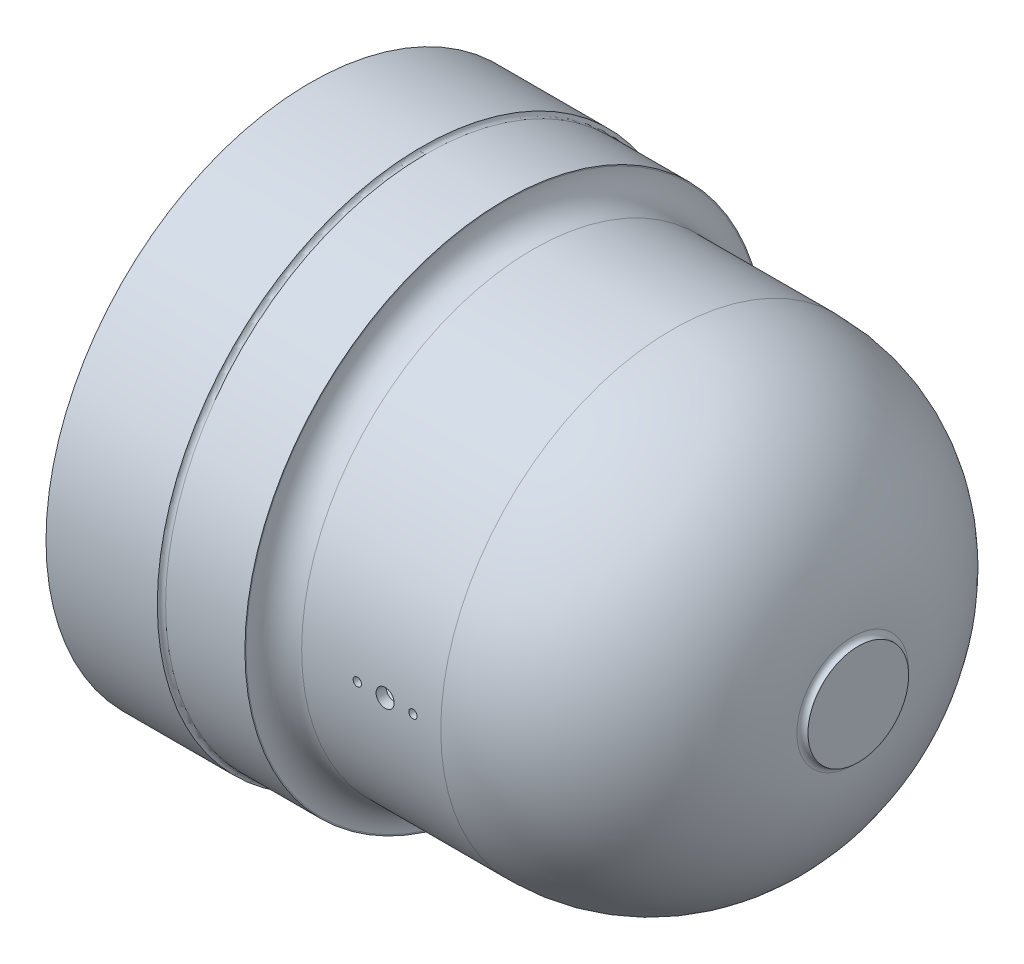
ISO-10303-21;
HEADER;
FILE_DESCRIPTION(('STEP AP214'),'2;1');
FILE_NAME('part.step','',(''),(''),'','','');
FILE_SCHEMA(('AUTOMOTIVE_DESIGN { 1 0 10303 214 1 1 1 1 }'));
ENDSEC;
DATA;
#1=APPLICATION_CONTEXT('core data for automotive mechanical design processes');
#2=APPLICATION_PROTOCOL_DEFINITION('international standard','automotive_design',2000,#1);
#3=PRODUCT_CONTEXT('',#1,'mechanical');
#4=PRODUCT('Part','Part','',(#3));
#5=PRODUCT_RELATED_PRODUCT_CATEGORY('part','',(#4));
#6=PRODUCT_DEFINITION_FORMATION('','',#4);
#7=PRODUCT_DEFINITION_CONTEXT('part definition',#1,'design');
#8=PRODUCT_DEFINITION('design','',#6,#7);
#9=PRODUCT_DEFINITION_SHAPE('','',#8);
#10=(LENGTH_UNIT() NAMED_UNIT(*) SI_UNIT(.MILLI.,.METRE.));
#11=(NAMED_UNIT(*) PLANE_ANGLE_UNIT() SI_UNIT($,.RADIAN.));
#12=(NAMED_UNIT(*) SI_UNIT($,.STERADIAN.) SOLID_ANGLE_UNIT());
#13=UNCERTAINTY_MEASURE_WITH_UNIT(LENGTH_MEASURE(1.E-05),#10,'distance_accuracy_value','');
#14=(GEOMETRIC_REPRESENTATION_CONTEXT(3) GLOBAL_UNCERTAINTY_ASSIGNED_CONTEXT((#13)) GLOBAL_UNIT_ASSIGNED_CONTEXT((#10,
#11,#12)) REPRESENTATION_CONTEXT('',''));
#15=CARTESIAN_POINT('',(0.,0.,0.));
#16=DIRECTION('',(0.,0.,1.));
#17=DIRECTION('',(1.,0.,0.));
#18=AXIS2_PLACEMENT_3D('',#15,#16,#17);
#19=CARTESIAN_POINT('',(-65.0147222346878,0.,0.));
#20=DIRECTION('',(-1.,0.,0.));
#21=DIRECTION('',(0.,0.,1.));
#22=AXIS2_PLACEMENT_3D('',#19,#20,#21);
#23=CYLINDRICAL_SURFACE('',#22,83.1);
#24=CARTESIAN_POINT('',(56.4852777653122,0.,83.1));
#25=CARTESIAN_POINT('',(56.4852740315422,-0.0842482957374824,83.0999998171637));
#26=CARTESIAN_POINT('',(56.4781561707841,-0.168557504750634,83.0998705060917));
#27=CARTESIAN_POINT('',(56.4498606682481,-0.334853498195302,83.0993670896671));
#28=CARTESIAN_POINT('',(56.4286661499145,-0.416837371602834,83.0989926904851));
#29=CARTESIAN_POINT('',(56.3728213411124,-0.576049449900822,83.0980415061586));
#30=CARTESIAN_POINT('',(56.3381775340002,-0.653279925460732,83.0974648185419));
#31=CARTESIAN_POINT('',(56.2564266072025,-0.800807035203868,83.0961741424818));
#32=CARTESIAN_POINT('',(56.2093225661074,-0.871105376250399,83.0954601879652));
#33=CARTESIAN_POINT('',(56.1039730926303,-1.00281262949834,83.0939751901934));
#34=CARTESIAN_POINT('',(56.0457253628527,-1.06421970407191,83.0932041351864));
#35=CARTESIAN_POINT('',(55.9197450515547,-1.17638615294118,83.0916919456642));
#36=CARTESIAN_POINT('',(55.8520120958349,-1.22714510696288,83.0909508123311));
#37=CARTESIAN_POINT('',(55.7089814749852,-1.31657398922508,83.0895820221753));
#38=CARTESIAN_POINT('',(55.6336834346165,-1.35524331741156,83.0889543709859));
#39=CARTESIAN_POINT('',(55.4776628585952,-1.41939115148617,83.087883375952));
#40=CARTESIAN_POINT('',(55.3969403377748,-1.44486969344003,83.0874400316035));
#41=CARTESIAN_POINT('',(55.2323714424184,-1.48191014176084,83.0867876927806));
#42=CARTESIAN_POINT('',(55.1485254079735,-1.49347355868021,83.0865786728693));
#43=CARTESIAN_POINT('',(54.9800820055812,-1.50236014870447,83.0864184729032));
#44=CARTESIAN_POINT('',(54.8954846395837,-1.49968335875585,83.0864672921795));
#45=CARTESIAN_POINT('',(54.7279502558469,-1.48016684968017,83.0868172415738));
#46=CARTESIAN_POINT('',(54.6450130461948,-1.46332877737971,83.0871183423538));
#47=CARTESIAN_POINT('',(54.4831427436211,-1.4159702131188,83.087938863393));
#48=CARTESIAN_POINT('',(54.4042096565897,-1.38544970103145,83.0884582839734));
#49=CARTESIAN_POINT('',(54.2525830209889,-1.31159074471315,83.0896569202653));
#50=CARTESIAN_POINT('',(54.1798898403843,-1.26825154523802,83.0903361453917));
#51=CARTESIAN_POINT('',(54.0428105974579,-1.16998605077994,83.0917778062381));
#52=CARTESIAN_POINT('',(53.9784245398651,-1.11505974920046,83.0925402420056));
#53=CARTESIAN_POINT('',(53.8597776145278,-0.995169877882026,83.0940624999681));
#54=CARTESIAN_POINT('',(53.8055181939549,-0.93020487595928,83.0948223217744));
#55=CARTESIAN_POINT('',(53.7086759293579,-0.792086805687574,83.0962535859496));
#56=CARTESIAN_POINT('',(53.6660930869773,-0.718933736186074,83.0969250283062));
#57=CARTESIAN_POINT('',(53.5938129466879,-0.566515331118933,83.0981038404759));
#58=CARTESIAN_POINT('',(53.5641156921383,-0.487249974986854,83.0986112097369));
#59=CARTESIAN_POINT('',(53.5184506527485,-0.324857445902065,83.0994046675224));
#60=CARTESIAN_POINT('',(53.5024828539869,-0.241730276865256,83.0996907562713));
#61=CARTESIAN_POINT('',(53.4847317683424,-0.0739864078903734,83.100009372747));
#62=CARTESIAN_POINT('',(53.4829464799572,0.0106300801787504,83.1000419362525));
#63=CARTESIAN_POINT('',(53.4936058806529,0.178961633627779,83.0998499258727));
#64=CARTESIAN_POINT('',(53.5060505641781,0.262676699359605,83.0996253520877));
#65=CARTESIAN_POINT('',(53.5448149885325,0.426823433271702,83.0989444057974));
#66=CARTESIAN_POINT('',(53.5711338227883,0.507255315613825,83.0984880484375));
#67=CARTESIAN_POINT('',(53.6368985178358,0.66255903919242,83.0973949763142));
#68=CARTESIAN_POINT('',(53.6763443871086,0.737430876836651,83.0967582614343));
#69=CARTESIAN_POINT('',(53.7672485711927,0.879498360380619,83.0953761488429));
#70=CARTESIAN_POINT('',(53.8187082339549,0.946693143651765,83.0946307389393));
#71=CARTESIAN_POINT('',(53.9321772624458,1.07149043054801,83.0931153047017));
#72=CARTESIAN_POINT('',(53.9941866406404,1.12909292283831,83.0923452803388));
#73=CARTESIAN_POINT('',(54.127003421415,1.23307713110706,83.090867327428));
#74=CARTESIAN_POINT('',(54.1978118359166,1.27945755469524,83.0901594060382));
#75=CARTESIAN_POINT('',(54.3462114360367,1.35967217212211,83.0888855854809));
#76=CARTESIAN_POINT('',(54.423802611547,1.39350638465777,83.0883196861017));
#77=CARTESIAN_POINT('',(54.5835603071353,1.44766590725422,83.0873937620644));
#78=CARTESIAN_POINT('',(54.66572654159,1.46799205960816,83.08703372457));
#79=CARTESIAN_POINT('',(54.8323060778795,1.49456124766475,83.0865600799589));
#80=CARTESIAN_POINT('',(54.9167193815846,1.5008042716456,83.0864464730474));
#81=CARTESIAN_POINT('',(55.085383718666,1.49902984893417,83.0864785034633));
#82=CARTESIAN_POINT('',(55.1696347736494,1.49101445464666,83.0866241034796));
#83=CARTESIAN_POINT('',(55.3355952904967,1.46095491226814,83.0871580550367));
#84=CARTESIAN_POINT('',(55.4173047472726,1.43891073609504,83.0875464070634));
#85=CARTESIAN_POINT('',(55.5758642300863,1.38141934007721,83.0885220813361));
#86=CARTESIAN_POINT('',(55.6527141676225,1.3459718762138,83.0891094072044));
#87=CARTESIAN_POINT('',(55.7993696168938,1.26268180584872,83.0904167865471));
#88=CARTESIAN_POINT('',(55.8691753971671,1.21483967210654,83.0911368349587));
#89=CARTESIAN_POINT('',(55.9997681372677,1.10811598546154,83.0926285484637));
#90=CARTESIAN_POINT('',(56.0605547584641,1.04923401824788,83.0934002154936));
#91=CARTESIAN_POINT('',(56.1713957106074,0.922083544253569,83.0949083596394));
#92=CARTESIAN_POINT('',(56.2214473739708,0.85381271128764,83.0956448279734));
#93=CARTESIAN_POINT('',(56.3094008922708,0.709805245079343,83.0969997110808));
#94=CARTESIAN_POINT('',(56.3472961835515,0.634064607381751,83.0976180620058));
#95=CARTESIAN_POINT('',(56.4097891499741,0.477354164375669,83.0986657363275));
#96=CARTESIAN_POINT('',(56.4344027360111,0.396390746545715,83.0990952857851));
#97=CARTESIAN_POINT('',(56.4630870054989,0.262427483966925,83.099601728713));
#98=CARTESIAN_POINT('',(56.4713981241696,0.210297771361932,83.0997504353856));
#99=CARTESIAN_POINT('',(56.4824946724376,0.105453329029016,83.0999496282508));
#100=CARTESIAN_POINT('',(56.4852801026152,0.0527385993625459,83.1000001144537));
#101=CARTESIAN_POINT('',(56.4852777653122,0.,83.1));
#102=B_SPLINE_CURVE_WITH_KNOTS('',3,(#24,#25,#26,#27,#28,#29,#30,#31,#32,#33,#34,#35,#36,#37,
#38,#39,#40,#41,#42,#43,#44,#45,#46,#47,#48,#49,#50,#51,#52,#53,#54,#55,#56,#57,#58,#59,#60,#61,
#62,#63,#64,#65,#66,#67,#68,#69,#70,#71,#72,#73,#74,#75,#76,#77,#78,#79,#80,#81,#82,#83,#84,#85,
#86,#87,#88,#89,#90,#91,#92,#93,#94,#95,#96,#97,#98,#99,#100,#101),.UNSPECIFIED.,.T.,.F.,(4,2,2,
2,2,2,2,2,2,2,2,2,2,2,2,2,2,2,2,2,2,2,2,2,2,2,2,2,2,2,2,2,2,2,2,2,2,2,4),(0.,0.252552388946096,
0.505408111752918,0.758142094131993,1.01081369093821,1.26353743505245,1.5162711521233,
1.76901741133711,2.02176297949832,2.27448110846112,2.52719858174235,2.77988667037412,
3.03257513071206,3.28527848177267,3.53798197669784,3.79072155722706,4.04346117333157,
4.29620163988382,4.54894185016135,4.80164639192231,5.05435083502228,5.30703876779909,
5.55972686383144,5.81244332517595,6.06516008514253,6.31790593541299,6.57065140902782,
6.82338112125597,7.07611104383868,7.32880459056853,7.58149864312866,7.8341972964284,
8.08688631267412,8.33958481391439,8.59234603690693,8.84524350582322,9.09783733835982,
9.2559326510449,9.41402794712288),.UNSPECIFIED.);
#103=CARTESIAN_POINT('',(56.4852777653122,0.,83.1));
#104=VERTEX_POINT('',#103);
#105=EDGE_CURVE('E59',#104,#104,#102,.T.);
#106=ORIENTED_EDGE('',*,*,#105,.T.);
#107=EDGE_LOOP('',(#106));
#108=FACE_BOUND('',#107,.T.);
#109=CARTESIAN_POINT('',(64.9852777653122,0.,0.));
#110=DIRECTION('',(-1.,0.,0.));
#111=DIRECTION('',(0.,0.,1.));
#112=AXIS2_PLACEMENT_3D('',#109,#110,#111);
#113=CIRCLE('',#112,83.1);
#114=CARTESIAN_POINT('',(64.9852777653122,0.,83.1));
#115=VERTEX_POINT('',#114);
#116=EDGE_CURVE('E120',#115,#115,#113,.T.);
#117=ORIENTED_EDGE('',*,*,#116,.T.);
#118=EDGE_LOOP('',(#117));
#119=FACE_BOUND('',#118,.T.);
#120=CARTESIAN_POINT('',(14.9852777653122,0.,0.));
#121=DIRECTION('',(1.,0.,0.));
#122=DIRECTION('',(0.,0.,-1.));
#123=AXIS2_PLACEMENT_3D('',#120,#121,#122);
#124=CIRCLE('',#123,83.1);
#125=CARTESIAN_POINT('',(14.9852777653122,0.,-83.1));
#126=VERTEX_POINT('',#125);
#127=EDGE_CURVE('E126',#126,#126,#124,.T.);
#128=ORIENTED_EDGE('',*,*,#127,.T.);
#129=EDGE_LOOP('',(#128));
#130=FACE_BOUND('',#129,.T.);
#131=CARTESIAN_POINT('',(48.2352777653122,0.,83.1));
#132=CARTESIAN_POINT('',(48.2352696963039,-0.182479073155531,83.0999991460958));
#133=CARTESIAN_POINT('',(48.2198575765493,-0.365088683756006,83.0993924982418));
#134=CARTESIAN_POINT('',(48.1585923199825,-0.725273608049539,83.0970307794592));
#135=CARTESIAN_POINT('',(48.1127030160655,-0.902842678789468,83.0952743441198));
#136=CARTESIAN_POINT('',(47.9917963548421,-1.24767655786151,83.090811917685));
#137=CARTESIAN_POINT('',(47.9167934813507,-1.41494644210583,83.088106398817));
#138=CARTESIAN_POINT('',(47.7398101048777,-1.7344753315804,83.0820507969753));
#139=CARTESIAN_POINT('',(47.6378361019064,-1.88673794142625,83.0787008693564));
#140=CARTESIAN_POINT('',(47.4097269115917,-2.17207900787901,83.071730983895));
#141=CARTESIAN_POINT('',(47.2835777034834,-2.30514625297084,83.0681108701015));
#142=CARTESIAN_POINT('',(47.0107255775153,-2.5482242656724,83.0610099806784));
#143=CARTESIAN_POINT('',(46.8640218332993,-2.65823410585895,83.0575292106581));
#144=CARTESIAN_POINT('',(46.5541732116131,-2.85209998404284,83.0510985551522));
#145=CARTESIAN_POINT('',(46.3910233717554,-2.93594809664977,83.048148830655));
#146=CARTESIAN_POINT('',(46.0529488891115,-3.07505927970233,83.0431146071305));
#147=CARTESIAN_POINT('',(45.8780243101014,-3.13032250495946,83.0410301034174));
#148=CARTESIAN_POINT('',(45.5214614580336,-3.21066782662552,83.0379626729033));
#149=CARTESIAN_POINT('',(45.3398266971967,-3.23576548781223,83.0369791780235));
#150=CARTESIAN_POINT('',(44.9749197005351,-3.25511524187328,83.0362229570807));
#151=CARTESIAN_POINT('',(44.7916474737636,-3.24936750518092,83.0364502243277));
#152=CARTESIAN_POINT('',(44.4287736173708,-3.20720266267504,83.0380893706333));
#153=CARTESIAN_POINT('',(44.2491700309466,-3.17080236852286,83.039500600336));
#154=CARTESIAN_POINT('',(43.8986246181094,-3.06839171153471,83.0433475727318));
#155=CARTESIAN_POINT('',(43.727682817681,-3.00238125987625,83.0457833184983));
#156=CARTESIAN_POINT('',(43.3992592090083,-2.84260481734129,83.0514055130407));
#157=CARTESIAN_POINT('',(43.2417811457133,-2.74883113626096,83.0545921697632));
#158=CARTESIAN_POINT('',(42.9447962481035,-2.53619577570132,83.0613567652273));
#159=CARTESIAN_POINT('',(42.8052894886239,-2.4173339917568,83.0649347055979));
#160=CARTESIAN_POINT('',(42.5481093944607,-2.15780147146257,83.0720814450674));
#161=CARTESIAN_POINT('',(42.4304507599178,-2.01711616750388,83.0756502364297));
#162=CARTESIAN_POINT('',(42.2204200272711,-1.71798145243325,83.08237408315));
#163=CARTESIAN_POINT('',(42.1280479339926,-1.55953203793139,83.0855291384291));
#164=CARTESIAN_POINT('',(41.9712139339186,-1.2293585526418,83.0910699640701));
#165=CARTESIAN_POINT('',(41.9067525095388,-1.05763425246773,83.0934557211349));
#166=CARTESIAN_POINT('',(41.8075791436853,-0.705789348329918,83.097188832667));
#167=CARTESIAN_POINT('',(41.7728670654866,-0.525668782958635,83.0985361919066));
#168=CARTESIAN_POINT('',(41.7341957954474,-0.162272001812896,83.1000400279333));
#169=CARTESIAN_POINT('',(41.7302162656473,0.02100204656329,83.1001972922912));
#170=CARTESIAN_POINT('',(41.7530700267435,0.385615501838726,83.0993053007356));
#171=CARTESIAN_POINT('',(41.7799032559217,0.566954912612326,83.0982560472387));
#172=CARTESIAN_POINT('',(41.8636040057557,0.922494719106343,83.0950697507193));
#173=CARTESIAN_POINT('',(41.9204622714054,1.09669729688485,83.0929330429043));
#174=CARTESIAN_POINT('',(42.0625897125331,1.43308555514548,83.0878125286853));
#175=CARTESIAN_POINT('',(42.1478589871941,1.59527119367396,83.084828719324));
#176=CARTESIAN_POINT('',(42.3444402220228,1.90311524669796,83.0783479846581));
#177=CARTESIAN_POINT('',(42.4557658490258,2.04876492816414,83.0748507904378));
#178=CARTESIAN_POINT('',(42.7012796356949,2.31931486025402,83.0677382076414));
#179=CARTESIAN_POINT('',(42.835467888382,2.4442150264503,83.0641228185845));
#180=CARTESIAN_POINT('',(43.1229851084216,2.66978861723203,83.0571791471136));
#181=CARTESIAN_POINT('',(43.2763243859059,2.77044890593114,83.0538510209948));
#182=CARTESIAN_POINT('',(43.5977385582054,2.94459559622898,83.0478595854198));
#183=CARTESIAN_POINT('',(43.7658134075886,3.01808208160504,83.0451962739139));
#184=CARTESIAN_POINT('',(44.1118785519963,3.13577216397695,83.0408358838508));
#185=CARTESIAN_POINT('',(44.2898659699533,3.17998421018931,83.0391385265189));
#186=CARTESIAN_POINT('',(44.6507443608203,3.23789806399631,83.0369006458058));
#187=CARTESIAN_POINT('',(44.8336353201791,3.25159995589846,83.0363601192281));
#188=CARTESIAN_POINT('',(45.1989981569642,3.24810360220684,83.0364969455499));
#189=CARTESIAN_POINT('',(45.3814702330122,3.23092604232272,83.0371734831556));
#190=CARTESIAN_POINT('',(45.7409381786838,3.16620104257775,83.0396664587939));
#191=CARTESIAN_POINT('',(45.9179340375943,3.11865354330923,83.0414828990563));
#192=CARTESIAN_POINT('',(46.2614310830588,2.99454203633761,83.0460507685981));
#193=CARTESIAN_POINT('',(46.4279321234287,2.91797762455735,83.0488022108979));
#194=CARTESIAN_POINT('',(46.7457153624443,2.73801052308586,83.0549298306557));
#195=CARTESIAN_POINT('',(46.8969980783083,2.63460874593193,83.0583059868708));
#196=CARTESIAN_POINT('',(47.1801506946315,2.40383267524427,83.0653049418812));
#197=CARTESIAN_POINT('',(47.3120096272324,2.27644492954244,83.0689278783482));
#198=CARTESIAN_POINT('',(47.5525081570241,2.00130371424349,83.076011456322));
#199=CARTESIAN_POINT('',(47.6611420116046,1.8535452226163,83.0794720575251));
#200=CARTESIAN_POINT('',(47.8521377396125,1.54177630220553,83.0858425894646));
#201=CARTESIAN_POINT('',(47.9344793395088,1.37775345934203,83.0887520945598));
#202=CARTESIAN_POINT('',(48.0703586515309,1.0383250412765,83.0936855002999));
#203=CARTESIAN_POINT('',(48.1239305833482,0.862933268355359,83.0957104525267));
#204=CARTESIAN_POINT('',(48.1866097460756,0.572033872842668,83.0981075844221));
#205=CARTESIAN_POINT('',(48.2048371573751,0.458412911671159,83.0988141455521));
#206=CARTESIAN_POINT('',(48.2291737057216,0.229878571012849,83.09976062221));
#207=CARTESIAN_POINT('',(48.2352828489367,0.114965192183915,83.1000005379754));
#208=CARTESIAN_POINT('',(48.2352777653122,0.,83.1));
#209=B_SPLINE_CURVE_WITH_KNOTS('',3,(#131,#132,#133,#134,#135,#136,#137,#138,#139,#140,#141,
#142,#143,#144,#145,#146,#147,#148,#149,#150,#151,#152,#153,#154,#155,#156,#157,#158,#159,#160,
#161,#162,#163,#164,#165,#166,#167,#168,#169,#170,#171,#172,#173,#174,#175,#176,#177,#178,#179,
#180,#181,#182,#183,#184,#185,#186,#187,#188,#189,#190,#191,#192,#193,#194,#195,#196,#197,#198,
#199,#200,#201,#202,#203,#204,#205,#206,#207,#208),.UNSPECIFIED.,.T.,.F.,(4,2,2,2,2,2,2,2,2,2,2,
2,2,2,2,2,2,2,2,2,2,2,2,2,2,2,2,2,2,2,2,2,2,2,2,2,2,2,4),(0.,0.547017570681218,1.09468544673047,
1.6420812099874,2.18934517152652,2.73692749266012,3.2845318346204,3.83230190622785,
4.38006901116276,4.92755335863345,5.47503468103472,6.02221592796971,6.56939881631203,
7.11673341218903,7.66407028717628,8.21177410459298,8.75947802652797,9.30719141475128,
9.85490228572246,10.4022506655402,10.9495979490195,11.4967766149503,12.0439571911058,
12.5914254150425,13.1388958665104,13.6866623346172,14.2344271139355,14.7820337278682,
15.3296388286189,15.8768772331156,16.4241167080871,16.9713638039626,17.5185922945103,
18.0661286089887,18.6138001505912,19.161892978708,19.709332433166,20.0539637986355,
20.3985949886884),.UNSPECIFIED.);
#210=CARTESIAN_POINT('',(48.2352777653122,0.,83.1));
#211=VERTEX_POINT('',#210);
#212=EDGE_CURVE('E58',#211,#211,#209,.T.);
#213=ORIENTED_EDGE('',*,*,#212,.T.);
#214=EDGE_LOOP('',(#213));
#215=FACE_BOUND('',#214,.T.);
#216=CARTESIAN_POINT('',(36.4852777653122,0.,83.1));
#217=CARTESIAN_POINT('',(36.4852740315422,-0.0842482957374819,83.0999998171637));
#218=CARTESIAN_POINT('',(36.4781561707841,-0.168557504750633,83.0998705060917));
#219=CARTESIAN_POINT('',(36.4498606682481,-0.334853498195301,83.0993670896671));
#220=CARTESIAN_POINT('',(36.4286661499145,-0.416837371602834,83.0989926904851));
#221=CARTESIAN_POINT('',(36.3728213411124,-0.576049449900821,83.0980415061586));
#222=CARTESIAN_POINT('',(36.3381775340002,-0.653279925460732,83.0974648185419));
#223=CARTESIAN_POINT('',(36.2564266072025,-0.800807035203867,83.0961741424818));
#224=CARTESIAN_POINT('',(36.2093225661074,-0.871105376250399,83.0954601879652));
#225=CARTESIAN_POINT('',(36.1039730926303,-1.00281262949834,83.0939751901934));
#226=CARTESIAN_POINT('',(36.0457253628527,-1.06421970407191,83.0932041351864));
#227=CARTESIAN_POINT('',(35.9197450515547,-1.17638615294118,83.0916919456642));
#228=CARTESIAN_POINT('',(35.8520120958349,-1.22714510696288,83.0909508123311));
#229=CARTESIAN_POINT('',(35.7089814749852,-1.31657398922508,83.0895820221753));
#230=CARTESIAN_POINT('',(35.6336834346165,-1.35524331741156,83.0889543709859));
#231=CARTESIAN_POINT('',(35.4776628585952,-1.41939115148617,83.087883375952));
#232=CARTESIAN_POINT('',(35.3969403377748,-1.44486969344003,83.0874400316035));
#233=CARTESIAN_POINT('',(35.2323714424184,-1.48191014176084,83.0867876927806));
#234=CARTESIAN_POINT('',(35.1485254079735,-1.49347355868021,83.0865786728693));
#235=CARTESIAN_POINT('',(34.9800820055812,-1.50236014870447,83.0864184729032));
#236=CARTESIAN_POINT('',(34.8954846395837,-1.49968335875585,83.0864672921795));
#237=CARTESIAN_POINT('',(34.7279502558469,-1.48016684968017,83.0868172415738));
#238=CARTESIAN_POINT('',(34.6450130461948,-1.46332877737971,83.0871183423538));
#239=CARTESIAN_POINT('',(34.4831427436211,-1.4159702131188,83.087938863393));
#240=CARTESIAN_POINT('',(34.4042096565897,-1.38544970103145,83.0884582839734));
#241=CARTESIAN_POINT('',(34.2525830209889,-1.31159074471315,83.0896569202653));
#242=CARTESIAN_POINT('',(34.1798898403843,-1.26825154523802,83.0903361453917));
#243=CARTESIAN_POINT('',(34.0428105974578,-1.16998605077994,83.0917778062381));
#244=CARTESIAN_POINT('',(33.9784245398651,-1.11505974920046,83.0925402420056));
#245=CARTESIAN_POINT('',(33.8597776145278,-0.995169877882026,83.0940624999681));
#246=CARTESIAN_POINT('',(33.8055181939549,-0.930204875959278,83.0948223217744));
#247=CARTESIAN_POINT('',(33.7086759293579,-0.792086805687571,83.0962535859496));
#248=CARTESIAN_POINT('',(33.6660930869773,-0.718933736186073,83.0969250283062));
#249=CARTESIAN_POINT('',(33.5938129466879,-0.566515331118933,83.0981038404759));
#250=CARTESIAN_POINT('',(33.5641156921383,-0.487249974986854,83.0986112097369));
#251=CARTESIAN_POINT('',(33.5184506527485,-0.324857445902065,83.0994046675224));
#252=CARTESIAN_POINT('',(33.5024828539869,-0.241730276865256,83.0996907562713));
#253=CARTESIAN_POINT('',(33.4847317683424,-0.0739864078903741,83.100009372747));
#254=CARTESIAN_POINT('',(33.4829464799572,0.0106300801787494,83.1000419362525));
#255=CARTESIAN_POINT('',(33.4936058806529,0.178961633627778,83.0998499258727));
#256=CARTESIAN_POINT('',(33.5060505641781,0.262676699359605,83.0996253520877));
#257=CARTESIAN_POINT('',(33.5448149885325,0.426823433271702,83.0989444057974));
#258=CARTESIAN_POINT('',(33.5711338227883,0.507255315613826,83.0984880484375));
#259=CARTESIAN_POINT('',(33.6368985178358,0.662559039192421,83.0973949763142));
#260=CARTESIAN_POINT('',(33.6763443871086,0.737430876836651,83.0967582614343));
#261=CARTESIAN_POINT('',(33.7672485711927,0.879498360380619,83.0953761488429));
#262=CARTESIAN_POINT('',(33.8187082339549,0.946693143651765,83.0946307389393));
#263=CARTESIAN_POINT('',(33.9321772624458,1.07149043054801,83.0931153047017));
#264=CARTESIAN_POINT('',(33.9941866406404,1.12909292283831,83.0923452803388));
#265=CARTESIAN_POINT('',(34.127003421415,1.23307713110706,83.090867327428));
#266=CARTESIAN_POINT('',(34.1978118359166,1.27945755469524,83.0901594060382));
#267=CARTESIAN_POINT('',(34.3462114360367,1.35967217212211,83.0888855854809));
#268=CARTESIAN_POINT('',(34.423802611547,1.39350638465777,83.0883196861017));
#269=CARTESIAN_POINT('',(34.5835603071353,1.44766590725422,83.0873937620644));
#270=CARTESIAN_POINT('',(34.66572654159,1.46799205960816,83.08703372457));
#271=CARTESIAN_POINT('',(34.8323060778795,1.49456124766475,83.0865600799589));
#272=CARTESIAN_POINT('',(34.9167193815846,1.5008042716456,83.0864464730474));
#273=CARTESIAN_POINT('',(35.085383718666,1.49902984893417,83.0864785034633));
#274=CARTESIAN_POINT('',(35.1696347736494,1.49101445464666,83.0866241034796));
#275=CARTESIAN_POINT('',(35.3355952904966,1.46095491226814,83.0871580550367));
#276=CARTESIAN_POINT('',(35.4173047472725,1.43891073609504,83.0875464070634));
#277=CARTESIAN_POINT('',(35.5758642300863,1.38141934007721,83.0885220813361));
#278=CARTESIAN_POINT('',(35.6527141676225,1.34597187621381,83.0891094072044));
#279=CARTESIAN_POINT('',(35.7993696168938,1.26268180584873,83.0904167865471));
#280=CARTESIAN_POINT('',(35.8691753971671,1.21483967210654,83.0911368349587));
#281=CARTESIAN_POINT('',(35.9997681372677,1.10811598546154,83.0926285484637));
#282=CARTESIAN_POINT('',(36.0605547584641,1.04923401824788,83.0934002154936));
#283=CARTESIAN_POINT('',(36.1713957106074,0.92208354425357,83.0949083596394));
#284=CARTESIAN_POINT('',(36.2214473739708,0.85381271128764,83.0956448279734));
#285=CARTESIAN_POINT('',(36.3094008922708,0.709805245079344,83.0969997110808));
#286=CARTESIAN_POINT('',(36.3472961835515,0.634064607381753,83.0976180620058));
#287=CARTESIAN_POINT('',(36.4097891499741,0.477354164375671,83.0986657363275));
#288=CARTESIAN_POINT('',(36.4344027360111,0.396390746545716,83.0990952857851));
#289=CARTESIAN_POINT('',(36.4630870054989,0.262427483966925,83.099601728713));
#290=CARTESIAN_POINT('',(36.4713981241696,0.210297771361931,83.0997504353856));
#291=CARTESIAN_POINT('',(36.4824946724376,0.105453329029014,83.0999496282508));
#292=CARTESIAN_POINT('',(36.4852801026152,0.052738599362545,83.1000001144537));
#293=CARTESIAN_POINT('',(36.4852777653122,0.,83.1));
#294=B_SPLINE_CURVE_WITH_KNOTS('',3,(#216,#217,#218,#219,#220,#221,#222,#223,#224,#225,#226,
#227,#228,#229,#230,#231,#232,#233,#234,#235,#236,#237,#238,#239,#240,#241,#242,#243,#244,#245,
#246,#247,#248,#249,#250,#251,#252,#253,#254,#255,#256,#257,#258,#259,#260,#261,#262,#263,#264,
#265,#266,#267,#268,#269,#270,#271,#272,#273,#274,#275,#276,#277,#278,#279,#280,#281,#282,#283,
#284,#285,#286,#287,#288,#289,#290,#291,#292,#293),.UNSPECIFIED.,.T.,.F.,(4,2,2,2,2,2,2,2,2,2,2,
2,2,2,2,2,2,2,2,2,2,2,2,2,2,2,2,2,2,2,2,2,2,2,2,2,2,2,4),(0.,0.252552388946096,
0.505408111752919,0.758142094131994,1.01081369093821,1.26353743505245,1.5162711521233,
1.76901741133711,2.02176297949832,2.27448110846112,2.52719858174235,2.77988667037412,
3.03257513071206,3.28527848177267,3.53798197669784,3.79072155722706,4.04346117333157,
4.29620163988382,4.54894185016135,4.80164639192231,5.05435083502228,5.30703876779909,
5.55972686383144,5.81244332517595,6.06516008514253,6.317905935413,6.57065140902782,
6.82338112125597,7.07611104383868,7.32880459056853,7.58149864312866,7.83419729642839,
8.08688631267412,8.33958481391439,8.59234603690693,8.84524350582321,9.09783733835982,
9.2559326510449,9.41402794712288),.UNSPECIFIED.);
#295=CARTESIAN_POINT('',(36.4852777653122,0.,83.1));
#296=VERTEX_POINT('',#295);
#297=EDGE_CURVE('E181',#296,#296,#294,.T.);
#298=ORIENTED_EDGE('',*,*,#297,.T.);
#299=EDGE_LOOP('',(#298));
#300=FACE_BOUND('',#299,.T.);
#301=ADVANCED_FACE('F32',(#108,#119,#130,#215,#300),#23,.T.);
#302=CARTESIAN_POINT('',(-65.0147222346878,0.,0.));
#303=DIRECTION('',(-1.,0.,0.));
#304=DIRECTION('',(0.,0.,1.));
#305=AXIS2_PLACEMENT_3D('',#302,#303,#304);
#306=CYLINDRICAL_SURFACE('',#305,79.5);
#307=CARTESIAN_POINT('',(56.4852777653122,0.,79.5));
#308=CARTESIAN_POINT('',(56.4852740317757,-0.08424761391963,79.4999998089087));
#309=CARTESIAN_POINT('',(56.4781562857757,-0.168556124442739,79.4998646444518));
#310=CARTESIAN_POINT('',(56.4498612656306,-0.33485069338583,79.4993384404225));
#311=CARTESIAN_POINT('',(56.4286671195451,-0.416833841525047,79.4989470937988));
#312=CARTESIAN_POINT('',(56.3728233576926,-0.576044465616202,79.497952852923));
#313=CARTESIAN_POINT('',(56.338180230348,-0.653274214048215,79.4973500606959));
#314=CARTESIAN_POINT('',(56.2564309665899,-0.800800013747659,79.4960009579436));
#315=CARTESIAN_POINT('',(56.2093279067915,-0.871097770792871,79.4952546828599));
#316=CARTESIAN_POINT('',(56.1039801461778,-1.00280473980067,79.4937024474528));
#317=CARTESIAN_POINT('',(56.0457330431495,-1.06421203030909,79.4928964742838));
#318=CARTESIAN_POINT('',(55.9197539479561,-1.17637906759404,79.491315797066));
#319=CARTESIAN_POINT('',(55.8520215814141,-1.22713839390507,79.4905410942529));
#320=CARTESIAN_POINT('',(55.7089915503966,-1.31656847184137,79.4891102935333));
#321=CARTESIAN_POINT('',(55.6336934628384,-1.35523854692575,79.4884542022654));
#322=CARTESIAN_POINT('',(55.4776725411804,-1.41938781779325,79.4873346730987));
#323=CARTESIAN_POINT('',(55.3969497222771,-1.44486705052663,79.4868712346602));
#324=CARTESIAN_POINT('',(55.2323808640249,-1.48190855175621,79.4861893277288));
#325=CARTESIAN_POINT('',(55.1485351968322,-1.49347247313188,79.4859708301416));
#326=CARTESIAN_POINT('',(54.9800924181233,-1.50236016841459,79.4858033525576));
#327=CARTESIAN_POINT('',(54.8954953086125,-1.49968398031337,79.4858543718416));
#328=CARTESIAN_POINT('',(54.7279622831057,-1.48016887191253,79.4862201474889));
#329=CARTESIAN_POINT('',(54.6450261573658,-1.46333175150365,79.4865348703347));
#330=CARTESIAN_POINT('',(54.4831578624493,-1.41597549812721,79.4873925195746));
#331=CARTESIAN_POINT('',(54.4042256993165,-1.38545634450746,79.4879354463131));
#332=CARTESIAN_POINT('',(54.2526002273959,-1.31160029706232,79.4891883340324));
#333=CARTESIAN_POINT('',(54.1799073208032,-1.26826257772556,79.4898983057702));
#334=CARTESIAN_POINT('',(54.0428283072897,-1.1700002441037,79.4914052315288));
#335=CARTESIAN_POINT('',(53.9784422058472,-1.11507562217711,79.4922021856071));
#336=CARTESIAN_POINT('',(53.8597939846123,-0.995188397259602,79.4937933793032));
#337=CARTESIAN_POINT('',(53.8055334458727,-0.930224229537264,79.4945876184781));
#338=CARTESIAN_POINT('',(53.7086887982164,-0.792107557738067,79.4960837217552));
#339=CARTESIAN_POINT('',(53.666104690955,-0.718955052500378,79.4967855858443));
#340=CARTESIAN_POINT('',(53.5938219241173,-0.566537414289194,79.4980178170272));
#341=CARTESIAN_POINT('',(53.5641233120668,-0.487272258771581,79.4985481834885));
#342=CARTESIAN_POINT('',(53.518455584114,-0.324879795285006,79.4993776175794));
#343=CARTESIAN_POINT('',(53.5024864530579,-0.241752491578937,79.4996766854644));
#344=CARTESIAN_POINT('',(53.4847329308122,-0.0740091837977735,79.5000097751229));
#345=CARTESIAN_POINT('',(53.4829463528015,0.0106065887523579,79.500043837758));
#346=CARTESIAN_POINT('',(53.4936029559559,0.178936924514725,79.4998431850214));
#347=CARTESIAN_POINT('',(53.5060461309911,0.262651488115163,79.4996084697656));
#348=CARTESIAN_POINT('',(53.5448072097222,0.426796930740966,79.4988967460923));
#349=CARTESIAN_POINT('',(53.5711241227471,0.507228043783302,79.498419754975));
#350=CARTESIAN_POINT('',(53.6368846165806,0.662530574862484,79.4972772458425));
#351=CARTESIAN_POINT('',(53.6763282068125,0.737401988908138,79.4966117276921));
#352=CARTESIAN_POINT('',(53.7672280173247,0.879469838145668,79.495167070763));
#353=CARTESIAN_POINT('',(53.8186857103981,0.946665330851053,79.4943879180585));
#354=CARTESIAN_POINT('',(53.9321508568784,1.07146442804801,79.4928038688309));
#355=CARTESIAN_POINT('',(53.9941583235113,1.12906802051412,79.4919989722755));
#356=CARTESIAN_POINT('',(54.1269721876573,1.23305540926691,79.4904540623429));
#357=CARTESIAN_POINT('',(54.1977796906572,1.27943779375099,79.4897140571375));
#358=CARTESIAN_POINT('',(54.3461779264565,1.35965644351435,79.4883824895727));
#359=CARTESIAN_POINT('',(54.4237686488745,1.3934927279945,79.4877909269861));
#360=CARTESIAN_POINT('',(54.5835254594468,1.44765623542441,79.4868229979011));
#361=CARTESIAN_POINT('',(54.6656912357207,1.46798437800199,79.4864466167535));
#362=CARTESIAN_POINT('',(54.8322702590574,1.49455758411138,79.4859514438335));
#363=CARTESIAN_POINT('',(54.9166835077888,1.50080263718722,79.4858326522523));
#364=CARTESIAN_POINT('',(55.0853469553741,1.49903224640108,79.485866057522));
#365=CARTESIAN_POINT('',(55.1695971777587,1.49101904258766,79.4860182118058));
#366=CARTESIAN_POINT('',(55.3355563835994,1.46096417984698,79.486576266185));
#367=CARTESIAN_POINT('',(55.4172653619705,1.43892249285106,79.4869821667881));
#368=CARTESIAN_POINT('',(55.5758242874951,1.38143634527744,79.4880019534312));
#369=CARTESIAN_POINT('',(55.6526741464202,1.34599164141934,79.4886158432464));
#370=CARTESIAN_POINT('',(55.7993299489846,1.2627072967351,79.4899823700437));
#371=CARTESIAN_POINT('',(55.8691361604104,1.21486812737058,79.4907350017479));
#372=CARTESIAN_POINT('',(55.9997312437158,1.1081497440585,79.4922942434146));
#373=CARTESIAN_POINT('',(56.0605196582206,1.04926997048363,79.4931008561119));
#374=CARTESIAN_POINT('',(56.171364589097,0.922123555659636,79.4946773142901));
#375=CARTESIAN_POINT('',(56.2214184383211,0.853854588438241,79.4954471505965));
#376=CARTESIAN_POINT('',(56.3093769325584,0.709849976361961,79.4968634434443));
#377=CARTESIAN_POINT('',(56.3472749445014,0.634110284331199,79.4975098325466));
#378=CARTESIAN_POINT('',(56.40977343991,0.477401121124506,79.4986050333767));
#379=CARTESIAN_POINT('',(56.4343898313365,0.396438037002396,79.4990540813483));
#380=CARTESIAN_POINT('',(56.4630802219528,0.262467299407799,79.4995835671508));
#381=CARTESIAN_POINT('',(56.4713938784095,0.210329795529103,79.4997390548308));
#382=CARTESIAN_POINT('',(56.4824938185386,0.105469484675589,79.4999473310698));
#383=CARTESIAN_POINT('',(56.485280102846,0.0527466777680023,79.5000001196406));
#384=CARTESIAN_POINT('',(56.4852777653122,0.,79.5));
#385=B_SPLINE_CURVE_WITH_KNOTS('',3,(#307,#308,#309,#310,#311,#312,#313,#314,#315,#316,#317,
#318,#319,#320,#321,#322,#323,#324,#325,#326,#327,#328,#329,#330,#331,#332,#333,#334,#335,#336,
#337,#338,#339,#340,#341,#342,#343,#344,#345,#346,#347,#348,#349,#350,#351,#352,#353,#354,#355,
#356,#357,#358,#359,#360,#361,#362,#363,#364,#365,#366,#367,#368,#369,#370,#371,#372,#373,#374,
#375,#376,#377,#378,#379,#380,#381,#382,#383,#384),.UNSPECIFIED.,.T.,.F.,(4,2,2,2,2,2,2,2,2,2,2,
2,2,2,2,2,2,2,2,2,2,2,2,2,2,2,2,2,2,2,2,2,2,2,2,2,2,2,4),(0.,0.252550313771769,
0.505403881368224,0.758135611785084,1.0108049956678,1.26352890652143,1.51626279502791,
1.76901082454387,2.0217581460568,2.27447544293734,2.52719206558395,2.77987657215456,
3.03256146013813,3.28526262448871,3.53796395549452,3.79070471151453,4.04344550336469,
4.29618722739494,4.54892867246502,4.80163114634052,5.05433351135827,5.30701783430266,
5.55970233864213,5.81241783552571,6.06513364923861,6.31788124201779,6.57062844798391,
6.82335844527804,7.07608863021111,7.32877911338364,7.58147010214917,7.83416567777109,
8.08685164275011,8.33955041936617,8.59231190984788,8.84521109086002,9.09780668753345,
9.25592619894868,9.41404569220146),.UNSPECIFIED.);
#386=CARTESIAN_POINT('',(56.4852777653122,0.,79.5));
#387=VERTEX_POINT('',#386);
#388=EDGE_CURVE('E60',#387,#387,#385,.T.);
#389=ORIENTED_EDGE('',*,*,#388,.F.);
#390=EDGE_LOOP('',(#389));
#391=FACE_BOUND('',#390,.T.);
#392=CARTESIAN_POINT('',(64.9852777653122,0.,0.));
#393=DIRECTION('',(-1.,0.,0.));
#394=DIRECTION('',(0.,0.,1.));
#395=AXIS2_PLACEMENT_3D('',#392,#393,#394);
#396=CIRCLE('',#395,79.5);
#397=CARTESIAN_POINT('',(64.9852777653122,0.,79.5));
#398=VERTEX_POINT('',#397);
#399=EDGE_CURVE('E90',#398,#398,#396,.T.);
#400=ORIENTED_EDGE('',*,*,#399,.F.);
#401=EDGE_LOOP('',(#400));
#402=FACE_BOUND('',#401,.T.);
#403=CARTESIAN_POINT('',(14.9852777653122,0.,0.));
#404=DIRECTION('',(-1.,0.,0.));
#405=DIRECTION('',(0.,0.,1.));
#406=AXIS2_PLACEMENT_3D('',#403,#404,#405);
#407=CIRCLE('',#406,79.5);
#408=CARTESIAN_POINT('',(14.9852777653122,0.,79.5));
#409=VERTEX_POINT('',#408);
#410=EDGE_CURVE('E85',#409,#409,#407,.F.);
#411=ORIENTED_EDGE('',*,*,#410,.F.);
#412=EDGE_LOOP('',(#411));
#413=FACE_BOUND('',#412,.T.);
#414=CARTESIAN_POINT('',(48.2352777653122,0.,79.5));
#415=CARTESIAN_POINT('',(48.2352696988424,-0.182472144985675,79.499999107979));
#416=CARTESIAN_POINT('',(48.2198587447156,-0.365074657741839,79.4993650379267));
#417=CARTESIAN_POINT('',(48.1585983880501,-0.725245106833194,79.4968965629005));
#418=CARTESIAN_POINT('',(48.1127128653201,-0.902806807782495,79.4950607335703));
#419=CARTESIAN_POINT('',(47.9918168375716,-1.24762591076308,79.4903965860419));
#420=CARTESIAN_POINT('',(47.9168208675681,-1.41488840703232,79.4875687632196));
#421=CARTESIAN_POINT('',(47.7398543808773,-1.73440398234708,79.481239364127));
#422=CARTESIAN_POINT('',(47.6378903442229,-1.88666065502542,79.4777379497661));
#423=CARTESIAN_POINT('',(47.4097985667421,-2.17199880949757,79.4704526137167));
#424=CARTESIAN_POINT('',(47.2836557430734,-2.30506823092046,79.4666685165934));
#425=CARTESIAN_POINT('',(47.010816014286,-2.54815219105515,79.4592458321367));
#426=CARTESIAN_POINT('',(46.8641182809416,-2.65816580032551,79.4556072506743));
#427=CARTESIAN_POINT('',(46.5542756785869,-2.85204383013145,79.448884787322));
#428=CARTESIAN_POINT('',(46.3911253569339,-2.93589954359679,79.4458010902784));
#429=CARTESIAN_POINT('',(46.0530473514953,-3.07502534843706,79.4405381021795));
#430=CARTESIAN_POINT('',(45.8781197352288,-3.1302956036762,79.4383588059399));
#431=CARTESIAN_POINT('',(45.5215572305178,-3.21065163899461,79.4351518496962));
#432=CARTESIAN_POINT('',(45.3399261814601,-3.23575442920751,79.4341235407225));
#433=CARTESIAN_POINT('',(44.9750254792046,-3.25511541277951,79.4333325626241));
#434=CARTESIAN_POINT('',(44.7917558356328,-3.24937378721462,79.4335698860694));
#435=CARTESIAN_POINT('',(44.4288957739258,-3.2072231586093,79.4352828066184));
#436=CARTESIAN_POINT('',(44.2493032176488,-3.1708325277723,79.4367576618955));
#437=CARTESIAN_POINT('',(43.8987782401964,-3.06844533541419,79.4407782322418));
#438=CARTESIAN_POINT('',(43.727845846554,-3.00244867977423,79.4433239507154));
#439=CARTESIAN_POINT('',(43.3994341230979,-2.84270179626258,79.4492001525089));
#440=CARTESIAN_POINT('',(43.2419588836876,-2.748943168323,79.4525308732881));
#441=CARTESIAN_POINT('',(42.9449763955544,-2.53633996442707,79.4596013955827));
#442=CARTESIAN_POINT('',(42.8054692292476,-2.4174952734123,79.4633411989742));
#443=CARTESIAN_POINT('',(42.5482760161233,-2.15798970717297,79.4708116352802));
#444=CARTESIAN_POINT('',(42.4306060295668,-2.0173129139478,79.4745422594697));
#445=CARTESIAN_POINT('',(42.2205510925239,-1.71819248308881,79.4815711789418));
#446=CARTESIAN_POINT('',(42.1281661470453,-1.55974884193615,79.4848694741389));
#447=CARTESIAN_POINT('',(41.97130542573,-1.22958318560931,79.490662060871));
#448=CARTESIAN_POINT('',(41.9068301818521,-1.05786091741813,79.4931563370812));
#449=CARTESIAN_POINT('',(41.8076294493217,-0.706016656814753,79.4970595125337));
#450=CARTESIAN_POINT('',(41.7729038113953,-0.525894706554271,79.498468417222));
#451=CARTESIAN_POINT('',(41.7342077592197,-0.16250357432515,79.5000413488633));
#452=CARTESIAN_POINT('',(41.7302151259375,0.0207632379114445,79.5002062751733));
#453=CARTESIAN_POINT('',(41.7530404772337,0.385364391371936,79.4992750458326));
#454=CARTESIAN_POINT('',(41.7798583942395,0.566698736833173,79.4981788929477));
#455=CARTESIAN_POINT('',(41.8635251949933,0.922225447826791,79.4948495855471));
#456=CARTESIAN_POINT('',(41.9203639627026,1.09642019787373,79.4926168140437));
#457=CARTESIAN_POINT('',(42.0624487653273,1.4327963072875,79.4872657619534));
#458=CARTESIAN_POINT('',(42.1476949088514,1.59497762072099,79.4841474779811));
#459=CARTESIAN_POINT('',(42.3442317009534,1.90282528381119,79.477374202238));
#460=CARTESIAN_POINT('',(42.4555372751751,2.04848209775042,79.4737189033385));
#461=CARTESIAN_POINT('',(42.7010115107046,2.31905027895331,79.4662844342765));
#462=CARTESIAN_POINT('',(42.8351802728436,2.4439615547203,79.4625052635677));
#463=CARTESIAN_POINT('',(43.1226677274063,2.66956739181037,79.4552464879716));
#464=CARTESIAN_POINT('',(43.2759976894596,2.77024759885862,79.4517670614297));
#465=CARTESIAN_POINT('',(43.5973978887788,2.9444352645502,79.4455028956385));
#466=CARTESIAN_POINT('',(43.7654680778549,3.01794281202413,79.4427181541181));
#467=CARTESIAN_POINT('',(44.1115242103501,3.13567343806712,79.4381586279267));
#468=CARTESIAN_POINT('',(44.2895070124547,3.17990573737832,79.4363835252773));
#469=CARTESIAN_POINT('',(44.6503802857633,3.23786046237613,79.434042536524));
#470=CARTESIAN_POINT('',(44.8332707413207,3.25158298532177,79.4334766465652));
#471=CARTESIAN_POINT('',(45.1986246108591,3.24812758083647,79.4336180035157));
#472=CARTESIAN_POINT('',(45.3810882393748,3.23097225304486,79.4343243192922));
#473=CARTESIAN_POINT('',(45.7405428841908,3.16629473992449,79.4369285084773));
#474=CARTESIAN_POINT('',(45.9175338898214,3.1187724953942,79.438826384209));
#475=CARTESIAN_POINT('',(46.2610251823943,2.99471426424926,79.4435995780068));
#476=CARTESIAN_POINT('',(46.4275253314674,2.91817789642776,79.4464749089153));
#477=CARTESIAN_POINT('',(46.7453119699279,2.73826899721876,79.452878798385));
#478=CARTESIAN_POINT('',(46.8965989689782,2.63489736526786,79.4564073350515));
#479=CARTESIAN_POINT('',(47.17977520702,2.40417529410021,79.4637227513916));
#480=CARTESIAN_POINT('',(47.3116522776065,2.27680992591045,79.4675097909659));
#481=CARTESIAN_POINT('',(47.5521910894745,2.00171016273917,79.4749145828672));
#482=CARTESIAN_POINT('',(47.660847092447,1.85397074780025,79.4785322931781));
#483=CARTESIAN_POINT('',(47.851893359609,1.54223100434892,79.4851925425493));
#484=CARTESIAN_POINT('',(47.9342626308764,1.37821781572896,79.4882346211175));
#485=CARTESIAN_POINT('',(48.0701981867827,1.0388024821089,79.4933932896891));
#486=CARTESIAN_POINT('',(48.123798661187,0.8634141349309,79.4955109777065));
#487=CARTESIAN_POINT('',(48.1865403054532,0.572438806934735,79.4980190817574));
#488=CARTESIAN_POINT('',(48.2047936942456,0.458738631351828,79.498758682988));
#489=CARTESIAN_POINT('',(48.2291649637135,0.230042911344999,79.4997494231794));
#490=CARTESIAN_POINT('',(48.2352828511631,0.115047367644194,79.5000005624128));
#491=CARTESIAN_POINT('',(48.2352777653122,0.,79.5));
#492=B_SPLINE_CURVE_WITH_KNOTS('',3,(#414,#415,#416,#417,#418,#419,#420,#421,#422,#423,#424,
#425,#426,#427,#428,#429,#430,#431,#432,#433,#434,#435,#436,#437,#438,#439,#440,#441,#442,#443,
#444,#445,#446,#447,#448,#449,#450,#451,#452,#453,#454,#455,#456,#457,#458,#459,#460,#461,#462,
#463,#464,#465,#466,#467,#468,#469,#470,#471,#472,#473,#474,#475,#476,#477,#478,#479,#480,#481,
#482,#483,#484,#485,#486,#487,#488,#489,#490,#491),.UNSPECIFIED.,.T.,.F.,(4,2,2,2,2,2,2,2,2,2,2,
2,2,2,2,2,2,2,2,2,2,2,2,2,2,2,2,2,2,2,2,2,2,2,2,2,2,2,4),(0.,0.546996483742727,1.09464245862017,
1.64201534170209,2.18925681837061,2.73684078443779,3.28444682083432,3.83223494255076,
4.38001992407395,4.92749588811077,5.47496863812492,6.02211344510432,6.56925999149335,
7.11657226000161,7.663887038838,8.2116027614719,8.75931859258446,9.30704486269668,
9.85476838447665,10.4020958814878,10.9494221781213,11.4965641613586,12.0437082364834,
12.5911664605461,13.138627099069,13.6864112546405,14.2341936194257,14.7818033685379,
15.3294113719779,15.8766187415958,16.42382717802,16.9710428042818,17.5182400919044,
18.0657789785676,18.6134530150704,19.1615633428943,19.7090208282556,20.0538983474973,
20.3987756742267),.UNSPECIFIED.);
#493=CARTESIAN_POINT('',(48.2352777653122,0.,79.5));
#494=VERTEX_POINT('',#493);
#495=EDGE_CURVE('E53',#494,#494,#492,.T.);
#496=ORIENTED_EDGE('',*,*,#495,.F.);
#497=EDGE_LOOP('',(#496));
#498=FACE_BOUND('',#497,.T.);
#499=CARTESIAN_POINT('',(36.4852777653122,0.,79.5));
#500=CARTESIAN_POINT('',(36.4852740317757,-0.0842476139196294,79.4999998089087));
#501=CARTESIAN_POINT('',(36.4781562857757,-0.168556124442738,79.4998646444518));
#502=CARTESIAN_POINT('',(36.4498612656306,-0.334850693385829,79.4993384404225));
#503=CARTESIAN_POINT('',(36.4286671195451,-0.416833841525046,79.4989470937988));
#504=CARTESIAN_POINT('',(36.3728233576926,-0.576044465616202,79.497952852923));
#505=CARTESIAN_POINT('',(36.338180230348,-0.653274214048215,79.4973500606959));
#506=CARTESIAN_POINT('',(36.2564309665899,-0.800800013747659,79.4960009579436));
#507=CARTESIAN_POINT('',(36.2093279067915,-0.871097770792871,79.4952546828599));
#508=CARTESIAN_POINT('',(36.1039801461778,-1.00280473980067,79.4937024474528));
#509=CARTESIAN_POINT('',(36.0457330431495,-1.06421203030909,79.4928964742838));
#510=CARTESIAN_POINT('',(35.9197539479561,-1.17637906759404,79.491315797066));
#511=CARTESIAN_POINT('',(35.8520215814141,-1.22713839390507,79.4905410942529));
#512=CARTESIAN_POINT('',(35.7089915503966,-1.31656847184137,79.4891102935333));
#513=CARTESIAN_POINT('',(35.6336934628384,-1.35523854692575,79.4884542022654));
#514=CARTESIAN_POINT('',(35.4776725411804,-1.41938781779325,79.4873346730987));
#515=CARTESIAN_POINT('',(35.3969497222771,-1.44486705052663,79.4868712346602));
#516=CARTESIAN_POINT('',(35.2323808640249,-1.48190855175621,79.4861893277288));
#517=CARTESIAN_POINT('',(35.1485351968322,-1.49347247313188,79.4859708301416));
#518=CARTESIAN_POINT('',(34.9800924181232,-1.50236016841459,79.4858033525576));
#519=CARTESIAN_POINT('',(34.8954953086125,-1.49968398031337,79.4858543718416));
#520=CARTESIAN_POINT('',(34.7279622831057,-1.48016887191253,79.4862201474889));
#521=CARTESIAN_POINT('',(34.6450261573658,-1.46333175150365,79.4865348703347));
#522=CARTESIAN_POINT('',(34.4831578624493,-1.41597549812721,79.4873925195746));
#523=CARTESIAN_POINT('',(34.4042256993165,-1.38545634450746,79.4879354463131));
#524=CARTESIAN_POINT('',(34.2526002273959,-1.31160029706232,79.4891883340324));
#525=CARTESIAN_POINT('',(34.1799073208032,-1.26826257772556,79.4898983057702));
#526=CARTESIAN_POINT('',(34.0428283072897,-1.1700002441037,79.4914052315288));
#527=CARTESIAN_POINT('',(33.9784422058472,-1.11507562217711,79.4922021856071));
#528=CARTESIAN_POINT('',(33.8597939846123,-0.995188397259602,79.4937933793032));
#529=CARTESIAN_POINT('',(33.8055334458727,-0.930224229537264,79.4945876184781));
#530=CARTESIAN_POINT('',(33.7086887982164,-0.792107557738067,79.4960837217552));
#531=CARTESIAN_POINT('',(33.666104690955,-0.718955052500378,79.4967855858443));
#532=CARTESIAN_POINT('',(33.5938219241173,-0.566537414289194,79.4980178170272));
#533=CARTESIAN_POINT('',(33.5641233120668,-0.487272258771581,79.4985481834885));
#534=CARTESIAN_POINT('',(33.518455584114,-0.324879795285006,79.4993776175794));
#535=CARTESIAN_POINT('',(33.5024864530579,-0.241752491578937,79.4996766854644));
#536=CARTESIAN_POINT('',(33.4847329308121,-0.0740091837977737,79.5000097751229));
#537=CARTESIAN_POINT('',(33.4829463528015,0.0106065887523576,79.500043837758));
#538=CARTESIAN_POINT('',(33.4936029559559,0.178936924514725,79.4998431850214));
#539=CARTESIAN_POINT('',(33.5060461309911,0.262651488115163,79.4996084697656));
#540=CARTESIAN_POINT('',(33.5448072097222,0.426796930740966,79.4988967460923));
#541=CARTESIAN_POINT('',(33.5711241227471,0.507228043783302,79.498419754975));
#542=CARTESIAN_POINT('',(33.6368846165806,0.662530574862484,79.4972772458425));
#543=CARTESIAN_POINT('',(33.6763282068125,0.737401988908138,79.4966117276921));
#544=CARTESIAN_POINT('',(33.7672280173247,0.879469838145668,79.495167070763));
#545=CARTESIAN_POINT('',(33.8186857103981,0.946665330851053,79.4943879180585));
#546=CARTESIAN_POINT('',(33.9321508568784,1.07146442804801,79.4928038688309));
#547=CARTESIAN_POINT('',(33.9941583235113,1.12906802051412,79.4919989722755));
#548=CARTESIAN_POINT('',(34.1269721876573,1.23305540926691,79.4904540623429));
#549=CARTESIAN_POINT('',(34.1977796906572,1.27943779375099,79.4897140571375));
#550=CARTESIAN_POINT('',(34.3461779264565,1.35965644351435,79.4883824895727));
#551=CARTESIAN_POINT('',(34.4237686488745,1.3934927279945,79.4877909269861));
#552=CARTESIAN_POINT('',(34.5835254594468,1.44765623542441,79.4868229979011));
#553=CARTESIAN_POINT('',(34.6656912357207,1.46798437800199,79.4864466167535));
#554=CARTESIAN_POINT('',(34.8322702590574,1.49455758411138,79.4859514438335));
#555=CARTESIAN_POINT('',(34.9166835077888,1.50080263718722,79.4858326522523));
#556=CARTESIAN_POINT('',(35.0853469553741,1.49903224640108,79.485866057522));
#557=CARTESIAN_POINT('',(35.1695971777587,1.49101904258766,79.4860182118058));
#558=CARTESIAN_POINT('',(35.3355563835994,1.46096417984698,79.486576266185));
#559=CARTESIAN_POINT('',(35.4172653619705,1.43892249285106,79.4869821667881));
#560=CARTESIAN_POINT('',(35.5758242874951,1.38143634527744,79.4880019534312));
#561=CARTESIAN_POINT('',(35.6526741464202,1.34599164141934,79.4886158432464));
#562=CARTESIAN_POINT('',(35.7993299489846,1.2627072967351,79.4899823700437));
#563=CARTESIAN_POINT('',(35.8691361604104,1.21486812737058,79.4907350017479));
#564=CARTESIAN_POINT('',(35.9997312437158,1.1081497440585,79.4922942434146));
#565=CARTESIAN_POINT('',(36.0605196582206,1.04926997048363,79.4931008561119));
#566=CARTESIAN_POINT('',(36.171364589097,0.922123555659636,79.4946773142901));
#567=CARTESIAN_POINT('',(36.2214184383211,0.853854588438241,79.4954471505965));
#568=CARTESIAN_POINT('',(36.3093769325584,0.709849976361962,79.4968634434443));
#569=CARTESIAN_POINT('',(36.3472749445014,0.634110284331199,79.4975098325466));
#570=CARTESIAN_POINT('',(36.4097734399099,0.477401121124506,79.4986050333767));
#571=CARTESIAN_POINT('',(36.4343898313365,0.396438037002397,79.4990540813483));
#572=CARTESIAN_POINT('',(36.4630802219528,0.262467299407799,79.4995835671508));
#573=CARTESIAN_POINT('',(36.4713938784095,0.210329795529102,79.4997390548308));
#574=CARTESIAN_POINT('',(36.4824938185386,0.105469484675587,79.4999473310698));
#575=CARTESIAN_POINT('',(36.485280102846,0.0527466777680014,79.5000001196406));
#576=CARTESIAN_POINT('',(36.4852777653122,0.,79.5));
#577=B_SPLINE_CURVE_WITH_KNOTS('',3,(#499,#500,#501,#502,#503,#504,#505,#506,#507,#508,#509,
#510,#511,#512,#513,#514,#515,#516,#517,#518,#519,#520,#521,#522,#523,#524,#525,#526,#527,#528,
#529,#530,#531,#532,#533,#534,#535,#536,#537,#538,#539,#540,#541,#542,#543,#544,#545,#546,#547,
#548,#549,#550,#551,#552,#553,#554,#555,#556,#557,#558,#559,#560,#561,#562,#563,#564,#565,#566,
#567,#568,#569,#570,#571,#572,#573,#574,#575,#576),.UNSPECIFIED.,.T.,.F.,(4,2,2,2,2,2,2,2,2,2,2,
2,2,2,2,2,2,2,2,2,2,2,2,2,2,2,2,2,2,2,2,2,2,2,2,2,2,2,4),(0.,0.252550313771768,
0.505403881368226,0.758135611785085,1.01080499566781,1.26352890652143,1.51626279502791,
1.76901082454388,2.0217581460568,2.27447544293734,2.52719206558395,2.77987657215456,
3.03256146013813,3.28526262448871,3.53796395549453,3.79070471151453,4.04344550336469,
4.29618722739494,4.54892867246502,4.80163114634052,5.05433351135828,5.30701783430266,
5.55970233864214,5.81241783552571,6.06513364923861,6.31788124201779,6.57062844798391,
6.82335844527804,7.07608863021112,7.32877911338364,7.58147010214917,7.8341656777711,
8.08685164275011,8.33955041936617,8.59231190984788,8.84521109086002,9.09780668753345,
9.25592619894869,9.41404569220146),.UNSPECIFIED.);
#578=CARTESIAN_POINT('',(36.4852777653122,0.,79.5));
#579=VERTEX_POINT('',#578);
#580=EDGE_CURVE('E36',#579,#579,#577,.T.);
#581=ORIENTED_EDGE('',*,*,#580,.F.);
#582=EDGE_LOOP('',(#581));
#583=FACE_BOUND('',#582,.T.);
#584=ADVANCED_FACE('F64',(#391,#402,#413,#498,#583),#306,.F.);
#585=CARTESIAN_POINT('',(64.9852777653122,0.,0.));
#586=DIRECTION('',(-1.,0.,0.));
#587=DIRECTION('',(0.,0.,1.));
#588=AXIS2_PLACEMENT_3D('',#585,#586,#587);
#589=DEGENERATE_TOROIDAL_SURFACE('',#588,18.1,65.,.T.);
#590=CARTESIAN_POINT('',(129.956311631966,0.,0.));
#591=DIRECTION('',(-1.,0.,0.));
#592=DIRECTION('',(0.,0.,1.));
#593=AXIS2_PLACEMENT_3D('',#590,#591,#592);
#594=CIRCLE('',#593,20.0402985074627);
#595=CARTESIAN_POINT('',(129.956311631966,0.,20.0402985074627));
#596=VERTEX_POINT('',#595);
#597=EDGE_CURVE('E44',#596,#596,#594,.T.);
#598=ORIENTED_EDGE('',*,*,#597,.T.);
#599=EDGE_LOOP('',(#598));
#600=FACE_BOUND('',#599,.T.);
#601=ORIENTED_EDGE('',*,*,#116,.F.);
#602=EDGE_LOOP('',(#601));
#603=FACE_BOUND('',#602,.T.);
#604=ADVANCED_FACE('F168',(#600,#603),#589,.T.);
#605=CARTESIAN_POINT('',(-65.0147222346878,0.,0.));
#606=DIRECTION('',(-1.,0.,0.));
#607=DIRECTION('',(0.,0.,1.));
#608=AXIS2_PLACEMENT_3D('',#605,#606,#607);
#609=CYLINDRICAL_SURFACE('',#608,18.1);
#610=CARTESIAN_POINT('',(131.955420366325,0.,0.));
#611=DIRECTION('',(-1.,0.,0.));
#612=DIRECTION('',(0.,0.,1.));
#613=AXIS2_PLACEMENT_3D('',#610,#611,#612);
#614=CIRCLE('',#613,18.1);
#615=CARTESIAN_POINT('',(131.955420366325,0.,18.1));
#616=VERTEX_POINT('',#615);
#617=EDGE_CURVE('E12',#616,#616,#614,.F.);
#618=ORIENTED_EDGE('',*,*,#617,.T.);
#619=EDGE_LOOP('',(#618));
#620=FACE_BOUND('',#619,.T.);
#621=CARTESIAN_POINT('',(131.985277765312,0.,0.));
#622=DIRECTION('',(-1.,0.,0.));
#623=DIRECTION('',(0.,0.,1.));
#624=AXIS2_PLACEMENT_3D('',#621,#622,#623);
#625=CIRCLE('',#624,18.1);
#626=CARTESIAN_POINT('',(131.985277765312,0.,18.1));
#627=VERTEX_POINT('',#626);
#628=EDGE_CURVE('E117',#627,#627,#625,.T.);
#629=ORIENTED_EDGE('',*,*,#628,.T.);
#630=EDGE_LOOP('',(#629));
#631=FACE_BOUND('',#630,.T.);
#632=ADVANCED_FACE('F158',(#620,#631),#609,.T.);
#633=CARTESIAN_POINT('',(131.985277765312,18.1,0.));
#634=DIRECTION('',(1.,0.,0.));
#635=DIRECTION('',(0.,0.,-1.));
#636=AXIS2_PLACEMENT_3D('',#633,#634,#635);
#637=PLANE('',#636);
#638=ORIENTED_EDGE('',*,*,#628,.F.);
#639=EDGE_LOOP('',(#638));
#640=FACE_BOUND('',#639,.T.);
#641=ADVANCED_FACE('F150',(#640),#637,.T.);
#642=CARTESIAN_POINT('',(-65.0147222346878,0.,0.));
#643=DIRECTION('',(-1.,0.,0.));
#644=DIRECTION('',(0.,0.,1.));
#645=AXIS2_PLACEMENT_3D('',#642,#643,#644);
#646=PLANE('',#645);
#647=CARTESIAN_POINT('',(-65.0147222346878,0.,0.));
#648=DIRECTION('',(-1.,0.,0.));
#649=DIRECTION('',(0.,0.,1.));
#650=AXIS2_PLACEMENT_3D('',#647,#648,#649);
#651=CIRCLE('',#650,91.4);
#652=CARTESIAN_POINT('',(-65.0147222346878,0.,91.4));
#653=VERTEX_POINT('',#652);
#654=EDGE_CURVE('E93',#653,#653,#651,.T.);
#655=ORIENTED_EDGE('',*,*,#654,.F.);
#656=EDGE_LOOP('',(#655));
#657=FACE_BOUND('',#656,.T.);
#658=CARTESIAN_POINT('',(-65.0147222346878,0.,0.));
#659=DIRECTION('',(-1.,0.,0.));
#660=DIRECTION('',(0.,0.,1.));
#661=AXIS2_PLACEMENT_3D('',#658,#659,#660);
#662=CIRCLE('',#661,95.);
#663=CARTESIAN_POINT('',(-65.0147222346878,0.,95.));
#664=VERTEX_POINT('',#663);
#665=EDGE_CURVE('E114',#664,#664,#662,.T.);
#666=ORIENTED_EDGE('',*,*,#665,.T.);
#667=EDGE_LOOP('',(#666));
#668=FACE_BOUND('',#667,.T.);
#669=ADVANCED_FACE('F145',(#657,#668),#646,.T.);
#670=CARTESIAN_POINT('',(-65.0147222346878,0.,0.));
#671=DIRECTION('',(-1.,0.,0.));
#672=DIRECTION('',(0.,0.,1.));
#673=AXIS2_PLACEMENT_3D('',#670,#671,#672);
#674=CYLINDRICAL_SURFACE('',#673,95.);
#675=CARTESIAN_POINT('',(-25.0147222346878,0.,0.));
#676=DIRECTION('',(-1.,0.,0.));
#677=DIRECTION('',(0.,0.,1.));
#678=AXIS2_PLACEMENT_3D('',#675,#676,#677);
#679=CIRCLE('',#678,95.);
#680=CARTESIAN_POINT('',(-25.0147222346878,0.,95.));
#681=VERTEX_POINT('',#680);
#682=EDGE_CURVE('E111',#681,#681,#679,.T.);
#683=ORIENTED_EDGE('',*,*,#682,.T.);
#684=EDGE_LOOP('',(#683));
#685=FACE_BOUND('',#684,.T.);
#686=ORIENTED_EDGE('',*,*,#665,.F.);
#687=EDGE_LOOP('',(#686));
#688=FACE_BOUND('',#687,.T.);
#689=ADVANCED_FACE('F142',(#685,#688),#674,.T.);
#690=CARTESIAN_POINT('',(-65.0147222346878,0.,0.));
#691=DIRECTION('',(-1.,0.,0.));
#692=DIRECTION('',(0.,0.,1.));
#693=AXIS2_PLACEMENT_3D('',#690,#691,#692);
#694=CYLINDRICAL_SURFACE('',#693,93.5);
#695=CARTESIAN_POINT('',(-23.5147222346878,0.,0.));
#696=DIRECTION('',(1.,0.,0.));
#697=DIRECTION('',(0.,0.,-1.));
#698=AXIS2_PLACEMENT_3D('',#695,#696,#697);
#699=CIRCLE('',#698,93.5);
#700=CARTESIAN_POINT('',(-23.5147222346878,0.,-93.5));
#701=VERTEX_POINT('',#700);
#702=EDGE_CURVE('E49',#701,#701,#699,.T.);
#703=ORIENTED_EDGE('',*,*,#702,.T.);
#704=EDGE_LOOP('',(#703));
#705=FACE_BOUND('',#704,.T.);
#706=CARTESIAN_POINT('',(4.98527776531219,0.,0.));
#707=DIRECTION('',(-1.,0.,0.));
#708=DIRECTION('',(0.,0.,1.));
#709=AXIS2_PLACEMENT_3D('',#706,#707,#708);
#710=CIRCLE('',#709,93.5);
#711=CARTESIAN_POINT('',(4.98527776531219,0.,93.5));
#712=VERTEX_POINT('',#711);
#713=EDGE_CURVE('E106',#712,#712,#710,.T.);
#714=ORIENTED_EDGE('',*,*,#713,.T.);
#715=EDGE_LOOP('',(#714));
#716=FACE_BOUND('',#715,.T.);
#717=ADVANCED_FACE('F131',(#705,#716),#694,.T.);
#718=CARTESIAN_POINT('',(4.98527776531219,93.5,0.));
#719=DIRECTION('',(1.,0.,0.));
#720=DIRECTION('',(0.,0.,-1.));
#721=AXIS2_PLACEMENT_3D('',#718,#719,#720);
#722=PLANE('',#721);
#723=CARTESIAN_POINT('',(4.98527776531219,0.,0.));
#724=DIRECTION('',(1.,0.,0.));
#725=DIRECTION('',(0.,0.,-1.));
#726=AXIS2_PLACEMENT_3D('',#723,#724,#725);
#727=CIRCLE('',#726,93.1);
#728=CARTESIAN_POINT('',(4.98527776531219,0.,-93.1));
#729=VERTEX_POINT('',#728);
#730=EDGE_CURVE('E123',#729,#729,#727,.F.);
#731=ORIENTED_EDGE('',*,*,#730,.T.);
#732=EDGE_LOOP('',(#731));
#733=FACE_BOUND('',#732,.T.);
#734=ORIENTED_EDGE('',*,*,#713,.F.);
#735=EDGE_LOOP('',(#734));
#736=FACE_BOUND('',#735,.T.);
#737=ADVANCED_FACE('F237',(#733,#736),#722,.T.);
#738=CARTESIAN_POINT('',(14.9852777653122,0.,0.));
#739=DIRECTION('',(1.,0.,0.));
#740=DIRECTION('',(0.,0.,-1.));
#741=AXIS2_PLACEMENT_3D('',#738,#739,#740);
#742=TOROIDAL_SURFACE('',#741,93.1,10.);
#743=ORIENTED_EDGE('',*,*,#127,.F.);
#744=EDGE_LOOP('',(#743));
#745=FACE_BOUND('',#744,.T.);
#746=ORIENTED_EDGE('',*,*,#730,.F.);
#747=EDGE_LOOP('',(#746));
#748=FACE_BOUND('',#747,.T.);
#749=ADVANCED_FACE('F138',(#745,#748),#742,.F.);
#750=CARTESIAN_POINT('',(-23.5147222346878,0.,0.));
#751=DIRECTION('',(1.,0.,0.));
#752=DIRECTION('',(0.,0.,-1.));
#753=AXIS2_PLACEMENT_3D('',#750,#751,#752);
#754=TOROIDAL_SURFACE('',#753,95.,1.5);
#755=ORIENTED_EDGE('',*,*,#702,.F.);
#756=EDGE_LOOP('',(#755));
#757=FACE_BOUND('',#756,.T.);
#758=ORIENTED_EDGE('',*,*,#682,.F.);
#759=EDGE_LOOP('',(#758));
#760=FACE_BOUND('',#759,.T.);
#761=ADVANCED_FACE('F134',(#757,#760),#754,.F.);
#762=CARTESIAN_POINT('',(131.955420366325,0.,0.));
#763=DIRECTION('',(-1.,0.,0.));
#764=DIRECTION('',(0.,0.,1.));
#765=AXIS2_PLACEMENT_3D('',#762,#763,#764);
#766=TOROIDAL_SURFACE('',#765,20.1,2.);
#767=ORIENTED_EDGE('',*,*,#617,.F.);
#768=EDGE_LOOP('',(#767));
#769=FACE_BOUND('',#768,.T.);
#770=ORIENTED_EDGE('',*,*,#597,.F.);
#771=EDGE_LOOP('',(#770));
#772=FACE_BOUND('',#771,.T.);
#773=ADVANCED_FACE('F137',(#769,#772),#766,.F.);
#774=CARTESIAN_POINT('',(64.9852777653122,0.,0.));
#775=DIRECTION('',(-1.,0.,0.));
#776=DIRECTION('',(0.,0.,1.));
#777=AXIS2_PLACEMENT_3D('',#774,#775,#776);
#778=DEGENERATE_TOROIDAL_SURFACE('',#777,18.1,61.4,.T.);
#779=CARTESIAN_POINT('',(126.357915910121,0.,0.));
#780=DIRECTION('',(-1.,0.,0.));
#781=DIRECTION('',(0.,0.,1.));
#782=AXIS2_PLACEMENT_3D('',#779,#780,#781);
#783=CIRCLE('',#782,19.9328358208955);
#784=CARTESIAN_POINT('',(126.357915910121,0.,19.9328358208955));
#785=VERTEX_POINT('',#784);
#786=EDGE_CURVE('E94',#785,#785,#783,.T.);
#787=ORIENTED_EDGE('',*,*,#786,.F.);
#788=EDGE_LOOP('',(#787));
#789=FACE_BOUND('',#788,.T.);
#790=ORIENTED_EDGE('',*,*,#399,.T.);
#791=EDGE_LOOP('',(#790));
#792=FACE_BOUND('',#791,.T.);
#793=ADVANCED_FACE('F232',(#789,#792),#778,.F.);
#794=CARTESIAN_POINT('',(128.385277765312,18.1,0.));
#795=DIRECTION('',(1.,0.,0.));
#796=DIRECTION('',(0.,0.,-1.));
#797=AXIS2_PLACEMENT_3D('',#794,#795,#796);
#798=PLANE('',#797);
#799=CARTESIAN_POINT('',(128.385277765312,0.,0.));
#800=DIRECTION('',(-1.,0.,0.));
#801=DIRECTION('',(0.,0.,1.));
#802=AXIS2_PLACEMENT_3D('',#799,#800,#801);
#803=CIRCLE('',#802,15.7855960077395);
#804=CARTESIAN_POINT('',(128.385277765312,0.,15.7855960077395));
#805=VERTEX_POINT('',#804);
#806=EDGE_CURVE('E97',#805,#805,#803,.F.);
#807=ORIENTED_EDGE('',*,*,#806,.F.);
#808=EDGE_LOOP('',(#807));
#809=FACE_BOUND('',#808,.T.);
#810=ADVANCED_FACE('F225',(#809),#798,.F.);
#811=CARTESIAN_POINT('',(-65.0147222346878,0.,0.));
#812=DIRECTION('',(-1.,0.,0.));
#813=DIRECTION('',(0.,0.,1.));
#814=AXIS2_PLACEMENT_3D('',#811,#812,#813);
#815=CYLINDRICAL_SURFACE('',#814,91.4);
#816=CARTESIAN_POINT('',(-27.1272006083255,0.,0.));
#817=DIRECTION('',(1.,0.,0.));
#818=DIRECTION('',(0.,0.,-1.));
#819=AXIS2_PLACEMENT_3D('',#816,#817,#818);
#820=CIRCLE('',#819,91.4);
#821=CARTESIAN_POINT('',(-27.1272006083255,0.,-91.4));
#822=VERTEX_POINT('',#821);
#823=EDGE_CURVE('E81',#822,#822,#820,.F.);
#824=ORIENTED_EDGE('',*,*,#823,.F.);
#825=EDGE_LOOP('',(#824));
#826=FACE_BOUND('',#825,.T.);
#827=ORIENTED_EDGE('',*,*,#654,.T.);
#828=EDGE_LOOP('',(#827));
#829=FACE_BOUND('',#828,.T.);
#830=ADVANCED_FACE('F219',(#826,#829),#815,.F.);
#831=CARTESIAN_POINT('',(-65.0147222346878,0.,0.));
#832=DIRECTION('',(-1.,0.,0.));
#833=DIRECTION('',(0.,0.,1.));
#834=AXIS2_PLACEMENT_3D('',#831,#832,#833);
#835=CYLINDRICAL_SURFACE('',#834,89.9);
#836=CARTESIAN_POINT('',(-23.5147222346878,0.,0.));
#837=DIRECTION('',(-1.,0.,0.));
#838=DIRECTION('',(0.,0.,1.));
#839=AXIS2_PLACEMENT_3D('',#836,#837,#838);
#840=CIRCLE('',#839,89.9);
#841=CARTESIAN_POINT('',(-23.5147222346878,0.,89.9));
#842=VERTEX_POINT('',#841);
#843=EDGE_CURVE('E88',#842,#842,#840,.F.);
#844=ORIENTED_EDGE('',*,*,#843,.F.);
#845=EDGE_LOOP('',(#844));
#846=FACE_BOUND('',#845,.T.);
#847=CARTESIAN_POINT('',(1.76710845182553,0.,0.));
#848=DIRECTION('',(1.,0.,0.));
#849=DIRECTION('',(0.,0.,-1.));
#850=AXIS2_PLACEMENT_3D('',#847,#848,#849);
#851=CIRCLE('',#850,89.9);
#852=CARTESIAN_POINT('',(1.76710845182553,0.,-89.9));
#853=VERTEX_POINT('',#852);
#854=EDGE_CURVE('E89',#853,#853,#851,.F.);
#855=ORIENTED_EDGE('',*,*,#854,.F.);
#856=EDGE_LOOP('',(#855));
#857=FACE_BOUND('',#856,.T.);
#858=ADVANCED_FACE('F214',(#846,#857),#835,.F.);
#859=CARTESIAN_POINT('',(14.9852777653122,0.,0.));
#860=DIRECTION('',(1.,0.,0.));
#861=DIRECTION('',(0.,0.,-1.));
#862=AXIS2_PLACEMENT_3D('',#859,#860,#861);
#863=TOROIDAL_SURFACE('',#862,93.1,13.6);
#864=ORIENTED_EDGE('',*,*,#410,.T.);
#865=EDGE_LOOP('',(#864));
#866=FACE_BOUND('',#865,.T.);
#867=ORIENTED_EDGE('',*,*,#854,.T.);
#868=EDGE_LOOP('',(#867));
#869=FACE_BOUND('',#868,.T.);
#870=ADVANCED_FACE('F210',(#866,#869),#863,.T.);
#871=CARTESIAN_POINT('',(-23.5147222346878,0.,0.));
#872=DIRECTION('',(1.,0.,0.));
#873=DIRECTION('',(0.,0.,-1.));
#874=AXIS2_PLACEMENT_3D('',#871,#872,#873);
#875=TOROIDAL_SURFACE('',#874,95.,5.1);
#876=ORIENTED_EDGE('',*,*,#843,.T.);
#877=EDGE_LOOP('',(#876));
#878=FACE_BOUND('',#877,.T.);
#879=ORIENTED_EDGE('',*,*,#823,.T.);
#880=EDGE_LOOP('',(#879));
#881=FACE_BOUND('',#880,.T.);
#882=ADVANCED_FACE('F213',(#878,#881),#875,.T.);
#883=CARTESIAN_POINT('',(131.955420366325,0.,0.));
#884=DIRECTION('',(-1.,0.,0.));
#885=DIRECTION('',(0.,0.,1.));
#886=AXIS2_PLACEMENT_3D('',#883,#884,#885);
#887=TOROIDAL_SURFACE('',#886,20.1,5.6);
#888=ORIENTED_EDGE('',*,*,#806,.T.);
#889=EDGE_LOOP('',(#888));
#890=FACE_BOUND('',#889,.T.);
#891=ORIENTED_EDGE('',*,*,#786,.T.);
#892=EDGE_LOOP('',(#891));
#893=FACE_BOUND('',#892,.T.);
#894=ADVANCED_FACE('F71',(#890,#893),#887,.T.);
#895=CARTESIAN_POINT('',(44.9852777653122,0.,95.));
#896=DIRECTION('',(0.,0.,-1.));
#897=DIRECTION('',(-1.,0.,0.));
#898=AXIS2_PLACEMENT_3D('',#895,#896,#897);
#899=CYLINDRICAL_SURFACE('',#898,3.25);
#900=ORIENTED_EDGE('',*,*,#212,.F.);
#901=EDGE_LOOP('',(#900));
#902=FACE_BOUND('',#901,.T.);
#903=ORIENTED_EDGE('',*,*,#495,.T.);
#904=EDGE_LOOP('',(#903));
#905=FACE_BOUND('',#904,.T.);
#906=ADVANCED_FACE('F67',(#902,#905),#899,.F.);
#907=CARTESIAN_POINT('',(54.9852777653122,0.,95.));
#908=DIRECTION('',(0.,0.,-1.));
#909=DIRECTION('',(-1.,0.,0.));
#910=AXIS2_PLACEMENT_3D('',#907,#908,#909);
#911=CYLINDRICAL_SURFACE('',#910,1.5);
#912=ORIENTED_EDGE('',*,*,#105,.F.);
#913=EDGE_LOOP('',(#912));
#914=FACE_BOUND('',#913,.T.);
#915=ORIENTED_EDGE('',*,*,#388,.T.);
#916=EDGE_LOOP('',(#915));
#917=FACE_BOUND('',#916,.T.);
#918=ADVANCED_FACE('F70',(#914,#917),#911,.F.);
#919=CARTESIAN_POINT('',(34.9852777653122,0.,95.));
#920=DIRECTION('',(0.,0.,-1.));
#921=DIRECTION('',(-1.,0.,0.));
#922=AXIS2_PLACEMENT_3D('',#919,#920,#921);
#923=CYLINDRICAL_SURFACE('',#922,1.5);
#924=ORIENTED_EDGE('',*,*,#297,.F.);
#925=EDGE_LOOP('',(#924));
#926=FACE_BOUND('',#925,.T.);
#927=ORIENTED_EDGE('',*,*,#580,.T.);
#928=EDGE_LOOP('',(#927));
#929=FACE_BOUND('',#928,.T.);
#930=ADVANCED_FACE('F187',(#926,#929),#923,.F.);
#931=CLOSED_SHELL('',(#301,#584,#604,#632,#641,#669,#689,#717,#737,#749,#761,#773,#793,#810,
#830,#858,#870,#882,#894,#906,#918,#930));
#932=MANIFOLD_SOLID_BREP('B2',#931);
#933=ADVANCED_BREP_SHAPE_REPRESENTATION('',(#18,#932),#14);
#934=SHAPE_DEFINITION_REPRESENTATION(#9,#933);
ENDSEC;
END-ISO-10303-21;
